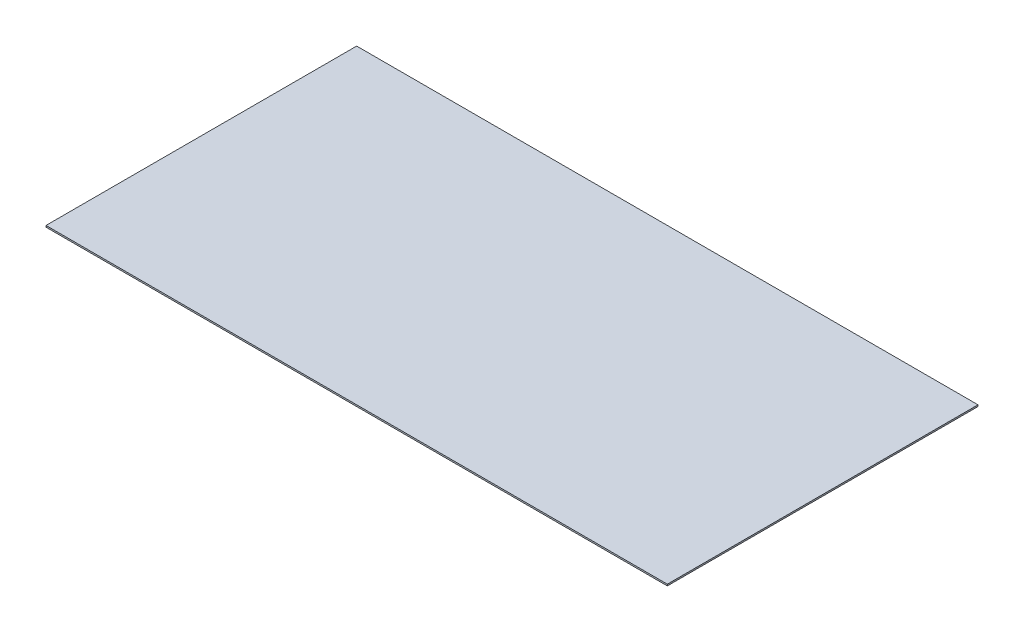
ISO-10303-21;
HEADER;
FILE_DESCRIPTION(('STEP AP214'),'2;1');
FILE_NAME('part.step','',(''),(''),'','','');
FILE_SCHEMA(('AUTOMOTIVE_DESIGN { 1 0 10303 214 1 1 1 1 }'));
ENDSEC;
DATA;
#1=APPLICATION_CONTEXT('core data for automotive mechanical design processes');
#2=APPLICATION_PROTOCOL_DEFINITION('international standard','automotive_design',2000,#1);
#3=PRODUCT_CONTEXT('',#1,'mechanical');
#4=PRODUCT('Part','Part','',(#3));
#5=PRODUCT_RELATED_PRODUCT_CATEGORY('part','',(#4));
#6=PRODUCT_DEFINITION_FORMATION('','',#4);
#7=PRODUCT_DEFINITION_CONTEXT('part definition',#1,'design');
#8=PRODUCT_DEFINITION('design','',#6,#7);
#9=PRODUCT_DEFINITION_SHAPE('','',#8);
#10=(LENGTH_UNIT() NAMED_UNIT(*) SI_UNIT(.MILLI.,.METRE.));
#11=(NAMED_UNIT(*) PLANE_ANGLE_UNIT() SI_UNIT($,.RADIAN.));
#12=(NAMED_UNIT(*) SI_UNIT($,.STERADIAN.) SOLID_ANGLE_UNIT());
#13=UNCERTAINTY_MEASURE_WITH_UNIT(LENGTH_MEASURE(1.E-05),#10,'distance_accuracy_value','');
#14=(GEOMETRIC_REPRESENTATION_CONTEXT(3) GLOBAL_UNCERTAINTY_ASSIGNED_CONTEXT((#13)) GLOBAL_UNIT_ASSIGNED_CONTEXT((#10,
#11,#12)) REPRESENTATION_CONTEXT('',''));
#15=CARTESIAN_POINT('',(0.,0.,0.));
#16=DIRECTION('',(0.,0.,1.));
#17=DIRECTION('',(1.,0.,0.));
#18=AXIS2_PLACEMENT_3D('',#15,#16,#17);
#19=CARTESIAN_POINT('',(-1609.95395917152,15.,1032.84052107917));
#20=DIRECTION('',(1.,0.,0.));
#21=DIRECTION('',(0.,0.,-1.));
#22=AXIS2_PLACEMENT_3D('',#19,#20,#21);
#23=PLANE('',#22);
#24=DIRECTION('',(0.,0.,1.));
#25=VECTOR('',#24,1.);
#26=CARTESIAN_POINT('',(-1609.95395917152,0.,1032.84052107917));
#27=LINE('',#26,#25);
#28=CARTESIAN_POINT('',(-1609.95395917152,0.,-1967.15947892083));
#29=VERTEX_POINT('',#28);
#30=CARTESIAN_POINT('',(-1609.95395917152,0.,1032.84052107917));
#31=VERTEX_POINT('',#30);
#32=EDGE_CURVE('E95',#29,#31,#27,.T.);
#33=ORIENTED_EDGE('',*,*,#32,.T.);
#34=DIRECTION('',(0.,-1.,0.));
#35=VECTOR('',#34,1.);
#36=CARTESIAN_POINT('',(-1609.95395917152,15.,1032.84052107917));
#37=LINE('',#36,#35);
#38=CARTESIAN_POINT('',(-1609.95395917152,15.,1032.84052107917));
#39=VERTEX_POINT('',#38);
#40=EDGE_CURVE('E11',#39,#31,#37,.T.);
#41=ORIENTED_EDGE('',*,*,#40,.F.);
#42=DIRECTION('',(0.,0.,1.));
#43=VECTOR('',#42,1.);
#44=CARTESIAN_POINT('',(-1609.95395917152,15.,1032.84052107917));
#45=LINE('',#44,#43);
#46=CARTESIAN_POINT('',(-1609.95395917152,15.,-1967.15947892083));
#47=VERTEX_POINT('',#46);
#48=EDGE_CURVE('E83',#47,#39,#45,.T.);
#49=ORIENTED_EDGE('',*,*,#48,.F.);
#50=DIRECTION('',(0.,-1.,0.));
#51=VECTOR('',#50,1.);
#52=CARTESIAN_POINT('',(-1609.95395917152,15.,-1967.15947892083));
#53=LINE('',#52,#51);
#54=EDGE_CURVE('E91',#47,#29,#53,.T.);
#55=ORIENTED_EDGE('',*,*,#54,.T.);
#56=EDGE_LOOP('',(#33,#41,#49,#55));
#57=FACE_BOUND('',#56,.T.);
#58=ADVANCED_FACE('F32',(#57),#23,.F.);
#59=CARTESIAN_POINT('',(-1609.95395917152,15.,1032.84052107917));
#60=DIRECTION('',(0.,0.,-1.));
#61=DIRECTION('',(-1.,0.,0.));
#62=AXIS2_PLACEMENT_3D('',#59,#60,#61);
#63=PLANE('',#62);
#64=DIRECTION('',(1.,0.,0.));
#65=VECTOR('',#64,1.);
#66=CARTESIAN_POINT('',(-1609.95395917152,0.,1032.84052107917));
#67=LINE('',#66,#65);
#68=CARTESIAN_POINT('',(4390.04604082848,0.,1032.84052107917));
#69=VERTEX_POINT('',#68);
#70=EDGE_CURVE('E87',#31,#69,#67,.T.);
#71=ORIENTED_EDGE('',*,*,#70,.T.);
#72=DIRECTION('',(0.,-1.,0.));
#73=VECTOR('',#72,1.);
#74=CARTESIAN_POINT('',(4390.04604082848,15.,1032.84052107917));
#75=LINE('',#74,#73);
#76=CARTESIAN_POINT('',(4390.04604082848,15.,1032.84052107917));
#77=VERTEX_POINT('',#76);
#78=EDGE_CURVE('E40',#77,#69,#75,.T.);
#79=ORIENTED_EDGE('',*,*,#78,.F.);
#80=DIRECTION('',(1.,0.,0.));
#81=VECTOR('',#80,1.);
#82=CARTESIAN_POINT('',(-1609.95395917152,15.,1032.84052107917));
#83=LINE('',#82,#81);
#84=EDGE_CURVE('E78',#39,#77,#83,.T.);
#85=ORIENTED_EDGE('',*,*,#84,.F.);
#86=ORIENTED_EDGE('',*,*,#40,.T.);
#87=EDGE_LOOP('',(#71,#79,#85,#86));
#88=FACE_BOUND('',#87,.T.);
#89=ADVANCED_FACE('F86',(#88),#63,.F.);
#90=CARTESIAN_POINT('',(4390.04604082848,15.,1032.84052107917));
#91=DIRECTION('',(-1.,0.,0.));
#92=DIRECTION('',(0.,0.,1.));
#93=AXIS2_PLACEMENT_3D('',#90,#91,#92);
#94=PLANE('',#93);
#95=DIRECTION('',(0.,0.,-1.));
#96=VECTOR('',#95,1.);
#97=CARTESIAN_POINT('',(4390.04604082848,0.,1032.84052107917));
#98=LINE('',#97,#96);
#99=CARTESIAN_POINT('',(4390.04604082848,0.,-1967.15947892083));
#100=VERTEX_POINT('',#99);
#101=EDGE_CURVE('E65',#69,#100,#98,.T.);
#102=ORIENTED_EDGE('',*,*,#101,.T.);
#103=DIRECTION('',(0.,-1.,0.));
#104=VECTOR('',#103,1.);
#105=CARTESIAN_POINT('',(4390.04604082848,15.,-1967.15947892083));
#106=LINE('',#105,#104);
#107=CARTESIAN_POINT('',(4390.04604082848,15.,-1967.15947892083));
#108=VERTEX_POINT('',#107);
#109=EDGE_CURVE('E88',#108,#100,#106,.T.);
#110=ORIENTED_EDGE('',*,*,#109,.F.);
#111=DIRECTION('',(0.,0.,-1.));
#112=VECTOR('',#111,1.);
#113=CARTESIAN_POINT('',(4390.04604082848,15.,1032.84052107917));
#114=LINE('',#113,#112);
#115=EDGE_CURVE('E81',#77,#108,#114,.T.);
#116=ORIENTED_EDGE('',*,*,#115,.F.);
#117=ORIENTED_EDGE('',*,*,#78,.T.);
#118=EDGE_LOOP('',(#102,#110,#116,#117));
#119=FACE_BOUND('',#118,.T.);
#120=ADVANCED_FACE('F89',(#119),#94,.F.);
#121=CARTESIAN_POINT('',(-1609.95395917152,15.,-1967.15947892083));
#122=DIRECTION('',(0.,0.,1.));
#123=DIRECTION('',(1.,0.,0.));
#124=AXIS2_PLACEMENT_3D('',#121,#122,#123);
#125=PLANE('',#124);
#126=DIRECTION('',(-1.,0.,0.));
#127=VECTOR('',#126,1.);
#128=CARTESIAN_POINT('',(-1609.95395917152,0.,-1967.15947892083));
#129=LINE('',#128,#127);
#130=EDGE_CURVE('E71',#100,#29,#129,.T.);
#131=ORIENTED_EDGE('',*,*,#130,.T.);
#132=ORIENTED_EDGE('',*,*,#54,.F.);
#133=DIRECTION('',(-1.,0.,0.));
#134=VECTOR('',#133,1.);
#135=CARTESIAN_POINT('',(-1609.95395917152,15.,-1967.15947892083));
#136=LINE('',#135,#134);
#137=EDGE_CURVE('E48',#108,#47,#136,.T.);
#138=ORIENTED_EDGE('',*,*,#137,.F.);
#139=ORIENTED_EDGE('',*,*,#109,.T.);
#140=EDGE_LOOP('',(#131,#132,#138,#139));
#141=FACE_BOUND('',#140,.T.);
#142=ADVANCED_FACE('F102',(#141),#125,.F.);
#143=CARTESIAN_POINT('',(0.,15.,0.));
#144=DIRECTION('',(0.,-1.,0.));
#145=DIRECTION('',(0.,0.,-1.));
#146=AXIS2_PLACEMENT_3D('',#143,#144,#145);
#147=PLANE('',#146);
#148=ORIENTED_EDGE('',*,*,#48,.T.);
#149=ORIENTED_EDGE('',*,*,#84,.T.);
#150=ORIENTED_EDGE('',*,*,#115,.T.);
#151=ORIENTED_EDGE('',*,*,#137,.T.);
#152=EDGE_LOOP('',(#148,#149,#150,#151));
#153=FACE_BOUND('',#152,.T.);
#154=ADVANCED_FACE('F79',(#153),#147,.F.);
#155=CARTESIAN_POINT('',(0.,0.,0.));
#156=DIRECTION('',(0.,-1.,0.));
#157=DIRECTION('',(0.,0.,-1.));
#158=AXIS2_PLACEMENT_3D('',#155,#156,#157);
#159=PLANE('',#158);
#160=ORIENTED_EDGE('',*,*,#32,.F.);
#161=ORIENTED_EDGE('',*,*,#130,.F.);
#162=ORIENTED_EDGE('',*,*,#101,.F.);
#163=ORIENTED_EDGE('',*,*,#70,.F.);
#164=EDGE_LOOP('',(#160,#161,#162,#163));
#165=FACE_BOUND('',#164,.T.);
#166=ADVANCED_FACE('F105',(#165),#159,.T.);
#167=CLOSED_SHELL('',(#58,#89,#120,#142,#154,#166));
#168=MANIFOLD_SOLID_BREP('B2',#167);
#169=ADVANCED_BREP_SHAPE_REPRESENTATION('',(#18,#168),#14);
#170=SHAPE_DEFINITION_REPRESENTATION(#9,#169);
ENDSEC;
END-ISO-10303-21;
